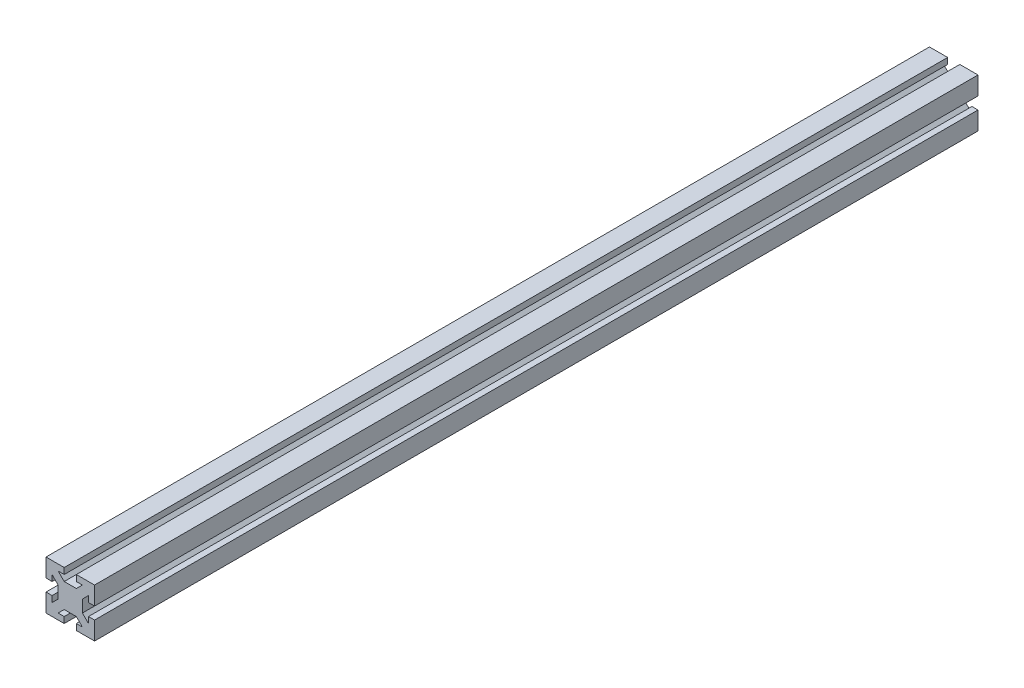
ISO-10303-21;
HEADER;
FILE_DESCRIPTION(('STEP AP214'),'2;1');
FILE_NAME('part.step','',(''),(''),'','','');
FILE_SCHEMA(('AUTOMOTIVE_DESIGN { 1 0 10303 214 1 1 1 1 }'));
ENDSEC;
DATA;
#1=APPLICATION_CONTEXT('core data for automotive mechanical design processes');
#2=APPLICATION_PROTOCOL_DEFINITION('international standard','automotive_design',2000,#1);
#3=PRODUCT_CONTEXT('',#1,'mechanical');
#4=PRODUCT('Part','Part','',(#3));
#5=PRODUCT_RELATED_PRODUCT_CATEGORY('part','',(#4));
#6=PRODUCT_DEFINITION_FORMATION('','',#4);
#7=PRODUCT_DEFINITION_CONTEXT('part definition',#1,'design');
#8=PRODUCT_DEFINITION('design','',#6,#7);
#9=PRODUCT_DEFINITION_SHAPE('','',#8);
#10=(LENGTH_UNIT() NAMED_UNIT(*) SI_UNIT(.MILLI.,.METRE.));
#11=(NAMED_UNIT(*) PLANE_ANGLE_UNIT() SI_UNIT($,.RADIAN.));
#12=(NAMED_UNIT(*) SI_UNIT($,.STERADIAN.) SOLID_ANGLE_UNIT());
#13=UNCERTAINTY_MEASURE_WITH_UNIT(LENGTH_MEASURE(1.E-05),#10,'distance_accuracy_value','');
#14=(GEOMETRIC_REPRESENTATION_CONTEXT(3) GLOBAL_UNCERTAINTY_ASSIGNED_CONTEXT((#13)) GLOBAL_UNIT_ASSIGNED_CONTEXT((#10,
#11,#12)) REPRESENTATION_CONTEXT('',''));
#15=CARTESIAN_POINT('',(0.,0.,0.));
#16=DIRECTION('',(0.,0.,1.));
#17=DIRECTION('',(1.,0.,0.));
#18=AXIS2_PLACEMENT_3D('',#15,#16,#17);
#19=CARTESIAN_POINT('',(20.,5.00000000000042,364.));
#20=DIRECTION('',(-1.,0.,0.));
#21=DIRECTION('',(0.,-1.,0.));
#22=AXIS2_PLACEMENT_3D('',#19,#20,#21);
#23=PLANE('',#22);
#24=DIRECTION('',(0.,1.,0.));
#25=VECTOR('',#24,1.);
#26=CARTESIAN_POINT('',(20.,5.00000000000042,-364.));
#27=LINE('',#26,#25);
#28=CARTESIAN_POINT('',(20.,5.00000000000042,-364.));
#29=VERTEX_POINT('',#28);
#30=CARTESIAN_POINT('',(20.,20.,-364.));
#31=VERTEX_POINT('',#30);
#32=EDGE_CURVE('E300',#29,#31,#27,.T.);
#33=ORIENTED_EDGE('',*,*,#32,.T.);
#34=DIRECTION('',(0.,0.,-1.));
#35=VECTOR('',#34,1.);
#36=CARTESIAN_POINT('',(20.,20.,364.));
#37=LINE('',#36,#35);
#38=CARTESIAN_POINT('',(20.,20.,364.));
#39=VERTEX_POINT('',#38);
#40=EDGE_CURVE('E11',#39,#31,#37,.T.);
#41=ORIENTED_EDGE('',*,*,#40,.F.);
#42=DIRECTION('',(0.,1.,0.));
#43=VECTOR('',#42,1.);
#44=CARTESIAN_POINT('',(20.,5.00000000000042,364.));
#45=LINE('',#44,#43);
#46=CARTESIAN_POINT('',(20.,5.00000000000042,364.));
#47=VERTEX_POINT('',#46);
#48=EDGE_CURVE('E370',#47,#39,#45,.T.);
#49=ORIENTED_EDGE('',*,*,#48,.F.);
#50=DIRECTION('',(0.,0.,-1.));
#51=VECTOR('',#50,1.);
#52=CARTESIAN_POINT('',(20.,5.00000000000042,364.));
#53=LINE('',#52,#51);
#54=EDGE_CURVE('E296',#47,#29,#53,.T.);
#55=ORIENTED_EDGE('',*,*,#54,.T.);
#56=EDGE_LOOP('',(#33,#41,#49,#55));
#57=FACE_BOUND('',#56,.T.);
#58=ADVANCED_FACE('F36',(#57),#23,.F.);
#59=CARTESIAN_POINT('',(5.,20.,364.));
#60=DIRECTION('',(0.,-1.,0.));
#61=DIRECTION('',(0.,0.,-1.));
#62=AXIS2_PLACEMENT_3D('',#59,#60,#61);
#63=PLANE('',#62);
#64=DIRECTION('',(-1.,0.,0.));
#65=VECTOR('',#64,1.);
#66=CARTESIAN_POINT('',(5.,20.,-364.));
#67=LINE('',#66,#65);
#68=CARTESIAN_POINT('',(5.,20.,-364.));
#69=VERTEX_POINT('',#68);
#70=EDGE_CURVE('E303',#31,#69,#67,.T.);
#71=ORIENTED_EDGE('',*,*,#70,.T.);
#72=DIRECTION('',(0.,0.,-1.));
#73=VECTOR('',#72,1.);
#74=CARTESIAN_POINT('',(5.,20.,364.));
#75=LINE('',#74,#73);
#76=CARTESIAN_POINT('',(5.,20.,364.));
#77=VERTEX_POINT('',#76);
#78=EDGE_CURVE('E44',#77,#69,#75,.T.);
#79=ORIENTED_EDGE('',*,*,#78,.F.);
#80=DIRECTION('',(-1.,0.,0.));
#81=VECTOR('',#80,1.);
#82=CARTESIAN_POINT('',(5.,20.,364.));
#83=LINE('',#82,#81);
#84=EDGE_CURVE('E179',#39,#77,#83,.T.);
#85=ORIENTED_EDGE('',*,*,#84,.F.);
#86=ORIENTED_EDGE('',*,*,#40,.T.);
#87=EDGE_LOOP('',(#71,#79,#85,#86));
#88=FACE_BOUND('',#87,.T.);
#89=ADVANCED_FACE('F568',(#88),#63,.F.);
#90=CARTESIAN_POINT('',(5.,15.,364.));
#91=DIRECTION('',(1.,0.,0.));
#92=DIRECTION('',(0.,0.,-1.));
#93=AXIS2_PLACEMENT_3D('',#90,#91,#92);
#94=PLANE('',#93);
#95=DIRECTION('',(0.,-1.,0.));
#96=VECTOR('',#95,1.);
#97=CARTESIAN_POINT('',(5.,15.,-364.));
#98=LINE('',#97,#96);
#99=CARTESIAN_POINT('',(5.,15.,-364.));
#100=VERTEX_POINT('',#99);
#101=EDGE_CURVE('E305',#69,#100,#98,.T.);
#102=ORIENTED_EDGE('',*,*,#101,.T.);
#103=DIRECTION('',(0.,0.,-1.));
#104=VECTOR('',#103,1.);
#105=CARTESIAN_POINT('',(5.,15.,364.));
#106=LINE('',#105,#104);
#107=CARTESIAN_POINT('',(5.,15.,364.));
#108=VERTEX_POINT('',#107);
#109=EDGE_CURVE('E461',#108,#100,#106,.T.);
#110=ORIENTED_EDGE('',*,*,#109,.F.);
#111=DIRECTION('',(0.,-1.,0.));
#112=VECTOR('',#111,1.);
#113=CARTESIAN_POINT('',(5.,15.,364.));
#114=LINE('',#113,#112);
#115=EDGE_CURVE('E469',#77,#108,#114,.T.);
#116=ORIENTED_EDGE('',*,*,#115,.F.);
#117=ORIENTED_EDGE('',*,*,#78,.T.);
#118=EDGE_LOOP('',(#102,#110,#116,#117));
#119=FACE_BOUND('',#118,.T.);
#120=ADVANCED_FACE('F467',(#119),#94,.F.);
#121=CARTESIAN_POINT('',(10.,15.,364.));
#122=DIRECTION('',(0.,1.,0.));
#123=DIRECTION('',(0.,0.,1.));
#124=AXIS2_PLACEMENT_3D('',#121,#122,#123);
#125=PLANE('',#124);
#126=DIRECTION('',(1.,0.,0.));
#127=VECTOR('',#126,1.);
#128=CARTESIAN_POINT('',(10.,15.,-364.));
#129=LINE('',#128,#127);
#130=CARTESIAN_POINT('',(10.,15.,-364.));
#131=VERTEX_POINT('',#130);
#132=EDGE_CURVE('E307',#100,#131,#129,.T.);
#133=ORIENTED_EDGE('',*,*,#132,.T.);
#134=DIRECTION('',(0.,0.,-1.));
#135=VECTOR('',#134,1.);
#136=CARTESIAN_POINT('',(10.,15.,364.));
#137=LINE('',#136,#135);
#138=CARTESIAN_POINT('',(10.,15.,364.));
#139=VERTEX_POINT('',#138);
#140=EDGE_CURVE('E458',#139,#131,#137,.T.);
#141=ORIENTED_EDGE('',*,*,#140,.F.);
#142=DIRECTION('',(1.,0.,0.));
#143=VECTOR('',#142,1.);
#144=CARTESIAN_POINT('',(10.,15.,364.));
#145=LINE('',#144,#143);
#146=EDGE_CURVE('E487',#108,#139,#145,.T.);
#147=ORIENTED_EDGE('',*,*,#146,.F.);
#148=ORIENTED_EDGE('',*,*,#109,.T.);
#149=EDGE_LOOP('',(#133,#141,#147,#148));
#150=FACE_BOUND('',#149,.T.);
#151=ADVANCED_FACE('F478',(#150),#125,.F.);
#152=CARTESIAN_POINT('',(5.,10.,364.));
#153=DIRECTION('',(0.707106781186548,-0.707106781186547,0.));
#154=DIRECTION('',(0.707106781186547,0.707106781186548,0.));
#155=AXIS2_PLACEMENT_3D('',#152,#153,#154);
#156=PLANE('',#155);
#157=DIRECTION('',(-0.707106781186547,-0.707106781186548,0.));
#158=VECTOR('',#157,1.);
#159=CARTESIAN_POINT('',(5.,10.,-364.));
#160=LINE('',#159,#158);
#161=CARTESIAN_POINT('',(5.,10.,-364.));
#162=VERTEX_POINT('',#161);
#163=EDGE_CURVE('E309',#131,#162,#160,.T.);
#164=ORIENTED_EDGE('',*,*,#163,.T.);
#165=DIRECTION('',(0.,0.,-1.));
#166=VECTOR('',#165,1.);
#167=CARTESIAN_POINT('',(5.,10.,364.));
#168=LINE('',#167,#166);
#169=CARTESIAN_POINT('',(5.,10.,364.));
#170=VERTEX_POINT('',#169);
#171=EDGE_CURVE('E455',#170,#162,#168,.T.);
#172=ORIENTED_EDGE('',*,*,#171,.F.);
#173=DIRECTION('',(-0.707106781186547,-0.707106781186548,0.));
#174=VECTOR('',#173,1.);
#175=CARTESIAN_POINT('',(5.,10.,364.));
#176=LINE('',#175,#174);
#177=EDGE_CURVE('E484',#139,#170,#176,.T.);
#178=ORIENTED_EDGE('',*,*,#177,.F.);
#179=ORIENTED_EDGE('',*,*,#140,.T.);
#180=EDGE_LOOP('',(#164,#172,#178,#179));
#181=FACE_BOUND('',#180,.T.);
#182=ADVANCED_FACE('F482',(#181),#156,.F.);
#183=CARTESIAN_POINT('',(-5.,10.,364.));
#184=DIRECTION('',(0.,-1.,0.));
#185=DIRECTION('',(0.,0.,-1.));
#186=AXIS2_PLACEMENT_3D('',#183,#184,#185);
#187=PLANE('',#186);
#188=DIRECTION('',(-1.,0.,0.));
#189=VECTOR('',#188,1.);
#190=CARTESIAN_POINT('',(-5.,10.,-364.));
#191=LINE('',#190,#189);
#192=CARTESIAN_POINT('',(-5.,10.,-364.));
#193=VERTEX_POINT('',#192);
#194=EDGE_CURVE('E311',#162,#193,#191,.T.);
#195=ORIENTED_EDGE('',*,*,#194,.T.);
#196=DIRECTION('',(0.,0.,-1.));
#197=VECTOR('',#196,1.);
#198=CARTESIAN_POINT('',(-5.,10.,364.));
#199=LINE('',#198,#197);
#200=CARTESIAN_POINT('',(-5.,10.,364.));
#201=VERTEX_POINT('',#200);
#202=EDGE_CURVE('E452',#201,#193,#199,.T.);
#203=ORIENTED_EDGE('',*,*,#202,.F.);
#204=DIRECTION('',(-1.,0.,0.));
#205=VECTOR('',#204,1.);
#206=CARTESIAN_POINT('',(-5.,10.,364.));
#207=LINE('',#206,#205);
#208=EDGE_CURVE('E486',#170,#201,#207,.T.);
#209=ORIENTED_EDGE('',*,*,#208,.F.);
#210=ORIENTED_EDGE('',*,*,#171,.T.);
#211=EDGE_LOOP('',(#195,#203,#209,#210));
#212=FACE_BOUND('',#211,.T.);
#213=ADVANCED_FACE('F581',(#212),#187,.F.);
#214=CARTESIAN_POINT('',(-10.,15.,364.));
#215=DIRECTION('',(-0.707106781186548,-0.707106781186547,0.));
#216=DIRECTION('',(0.707106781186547,-0.707106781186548,0.));
#217=AXIS2_PLACEMENT_3D('',#214,#215,#216);
#218=PLANE('',#217);
#219=DIRECTION('',(-0.707106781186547,0.707106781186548,0.));
#220=VECTOR('',#219,1.);
#221=CARTESIAN_POINT('',(-10.,15.,-364.));
#222=LINE('',#221,#220);
#223=CARTESIAN_POINT('',(-10.,15.,-364.));
#224=VERTEX_POINT('',#223);
#225=EDGE_CURVE('E313',#193,#224,#222,.T.);
#226=ORIENTED_EDGE('',*,*,#225,.T.);
#227=DIRECTION('',(0.,0.,-1.));
#228=VECTOR('',#227,1.);
#229=CARTESIAN_POINT('',(-10.,15.,364.));
#230=LINE('',#229,#228);
#231=CARTESIAN_POINT('',(-10.,15.,364.));
#232=VERTEX_POINT('',#231);
#233=EDGE_CURVE('E449',#232,#224,#230,.T.);
#234=ORIENTED_EDGE('',*,*,#233,.F.);
#235=DIRECTION('',(-0.707106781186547,0.707106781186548,0.));
#236=VECTOR('',#235,1.);
#237=CARTESIAN_POINT('',(-10.,15.,364.));
#238=LINE('',#237,#236);
#239=EDGE_CURVE('E489',#201,#232,#238,.T.);
#240=ORIENTED_EDGE('',*,*,#239,.F.);
#241=ORIENTED_EDGE('',*,*,#202,.T.);
#242=EDGE_LOOP('',(#226,#234,#240,#241));
#243=FACE_BOUND('',#242,.T.);
#244=ADVANCED_FACE('F584',(#243),#218,.F.);
#245=CARTESIAN_POINT('',(-5.,15.,364.));
#246=DIRECTION('',(0.,1.,0.));
#247=DIRECTION('',(0.,0.,1.));
#248=AXIS2_PLACEMENT_3D('',#245,#246,#247);
#249=PLANE('',#248);
#250=DIRECTION('',(1.,0.,0.));
#251=VECTOR('',#250,1.);
#252=CARTESIAN_POINT('',(-5.,15.,-364.));
#253=LINE('',#252,#251);
#254=CARTESIAN_POINT('',(-5.,15.,-364.));
#255=VERTEX_POINT('',#254);
#256=EDGE_CURVE('E315',#224,#255,#253,.T.);
#257=ORIENTED_EDGE('',*,*,#256,.T.);
#258=DIRECTION('',(0.,0.,-1.));
#259=VECTOR('',#258,1.);
#260=CARTESIAN_POINT('',(-5.,15.,364.));
#261=LINE('',#260,#259);
#262=CARTESIAN_POINT('',(-5.,15.,364.));
#263=VERTEX_POINT('',#262);
#264=EDGE_CURVE('E446',#263,#255,#261,.T.);
#265=ORIENTED_EDGE('',*,*,#264,.F.);
#266=DIRECTION('',(1.,0.,0.));
#267=VECTOR('',#266,1.);
#268=CARTESIAN_POINT('',(-5.,15.,364.));
#269=LINE('',#268,#267);
#270=EDGE_CURVE('E495',#232,#263,#269,.T.);
#271=ORIENTED_EDGE('',*,*,#270,.F.);
#272=ORIENTED_EDGE('',*,*,#233,.T.);
#273=EDGE_LOOP('',(#257,#265,#271,#272));
#274=FACE_BOUND('',#273,.T.);
#275=ADVANCED_FACE('F588',(#274),#249,.F.);
#276=CARTESIAN_POINT('',(-5.,20.,364.));
#277=DIRECTION('',(-1.,0.,0.));
#278=DIRECTION('',(0.,0.,1.));
#279=AXIS2_PLACEMENT_3D('',#276,#277,#278);
#280=PLANE('',#279);
#281=DIRECTION('',(0.,1.,0.));
#282=VECTOR('',#281,1.);
#283=CARTESIAN_POINT('',(-5.,20.,-364.));
#284=LINE('',#283,#282);
#285=CARTESIAN_POINT('',(-5.,20.,-364.));
#286=VERTEX_POINT('',#285);
#287=EDGE_CURVE('E317',#255,#286,#284,.T.);
#288=ORIENTED_EDGE('',*,*,#287,.T.);
#289=DIRECTION('',(0.,0.,-1.));
#290=VECTOR('',#289,1.);
#291=CARTESIAN_POINT('',(-5.,20.,364.));
#292=LINE('',#291,#290);
#293=CARTESIAN_POINT('',(-5.,20.,364.));
#294=VERTEX_POINT('',#293);
#295=EDGE_CURVE('E443',#294,#286,#292,.T.);
#296=ORIENTED_EDGE('',*,*,#295,.F.);
#297=DIRECTION('',(0.,1.,0.));
#298=VECTOR('',#297,1.);
#299=CARTESIAN_POINT('',(-5.,20.,364.));
#300=LINE('',#299,#298);
#301=EDGE_CURVE('E497',#263,#294,#300,.T.);
#302=ORIENTED_EDGE('',*,*,#301,.F.);
#303=ORIENTED_EDGE('',*,*,#264,.T.);
#304=EDGE_LOOP('',(#288,#296,#302,#303));
#305=FACE_BOUND('',#304,.T.);
#306=ADVANCED_FACE('F592',(#305),#280,.F.);
#307=CARTESIAN_POINT('',(-20.,20.,364.));
#308=DIRECTION('',(0.,-1.,0.));
#309=DIRECTION('',(0.,0.,-1.));
#310=AXIS2_PLACEMENT_3D('',#307,#308,#309);
#311=PLANE('',#310);
#312=DIRECTION('',(-1.,0.,0.));
#313=VECTOR('',#312,1.);
#314=CARTESIAN_POINT('',(-20.,20.,-364.));
#315=LINE('',#314,#313);
#316=CARTESIAN_POINT('',(-20.,20.,-364.));
#317=VERTEX_POINT('',#316);
#318=EDGE_CURVE('E319',#286,#317,#315,.T.);
#319=ORIENTED_EDGE('',*,*,#318,.T.);
#320=DIRECTION('',(0.,0.,-1.));
#321=VECTOR('',#320,1.);
#322=CARTESIAN_POINT('',(-20.,20.,364.));
#323=LINE('',#322,#321);
#324=CARTESIAN_POINT('',(-20.,20.,364.));
#325=VERTEX_POINT('',#324);
#326=EDGE_CURVE('E440',#325,#317,#323,.T.);
#327=ORIENTED_EDGE('',*,*,#326,.F.);
#328=DIRECTION('',(-1.,0.,0.));
#329=VECTOR('',#328,1.);
#330=CARTESIAN_POINT('',(-20.,20.,364.));
#331=LINE('',#330,#329);
#332=EDGE_CURVE('E499',#294,#325,#331,.T.);
#333=ORIENTED_EDGE('',*,*,#332,.F.);
#334=ORIENTED_EDGE('',*,*,#295,.T.);
#335=EDGE_LOOP('',(#319,#327,#333,#334));
#336=FACE_BOUND('',#335,.T.);
#337=ADVANCED_FACE('F596',(#336),#311,.F.);
#338=CARTESIAN_POINT('',(-20.,5.,364.));
#339=DIRECTION('',(1.,0.,0.));
#340=DIRECTION('',(0.,1.,0.));
#341=AXIS2_PLACEMENT_3D('',#338,#339,#340);
#342=PLANE('',#341);
#343=DIRECTION('',(0.,-1.,0.));
#344=VECTOR('',#343,1.);
#345=CARTESIAN_POINT('',(-20.,5.,-364.));
#346=LINE('',#345,#344);
#347=CARTESIAN_POINT('',(-20.,5.,-364.));
#348=VERTEX_POINT('',#347);
#349=EDGE_CURVE('E321',#317,#348,#346,.T.);
#350=ORIENTED_EDGE('',*,*,#349,.T.);
#351=DIRECTION('',(0.,0.,-1.));
#352=VECTOR('',#351,1.);
#353=CARTESIAN_POINT('',(-20.,5.,364.));
#354=LINE('',#353,#352);
#355=CARTESIAN_POINT('',(-20.,5.,364.));
#356=VERTEX_POINT('',#355);
#357=EDGE_CURVE('E437',#356,#348,#354,.T.);
#358=ORIENTED_EDGE('',*,*,#357,.F.);
#359=DIRECTION('',(0.,-1.,0.));
#360=VECTOR('',#359,1.);
#361=CARTESIAN_POINT('',(-20.,5.,364.));
#362=LINE('',#361,#360);
#363=EDGE_CURVE('E501',#325,#356,#362,.T.);
#364=ORIENTED_EDGE('',*,*,#363,.F.);
#365=ORIENTED_EDGE('',*,*,#326,.T.);
#366=EDGE_LOOP('',(#350,#358,#364,#365));
#367=FACE_BOUND('',#366,.T.);
#368=ADVANCED_FACE('F600',(#367),#342,.F.);
#369=CARTESIAN_POINT('',(-15.,5.,364.));
#370=DIRECTION('',(0.,1.,0.));
#371=DIRECTION('',(0.,0.,1.));
#372=AXIS2_PLACEMENT_3D('',#369,#370,#371);
#373=PLANE('',#372);
#374=DIRECTION('',(1.,0.,0.));
#375=VECTOR('',#374,1.);
#376=CARTESIAN_POINT('',(-15.,5.,-364.));
#377=LINE('',#376,#375);
#378=CARTESIAN_POINT('',(-15.,5.,-364.));
#379=VERTEX_POINT('',#378);
#380=EDGE_CURVE('E323',#348,#379,#377,.T.);
#381=ORIENTED_EDGE('',*,*,#380,.T.);
#382=DIRECTION('',(0.,0.,-1.));
#383=VECTOR('',#382,1.);
#384=CARTESIAN_POINT('',(-15.,5.,364.));
#385=LINE('',#384,#383);
#386=CARTESIAN_POINT('',(-15.,5.,364.));
#387=VERTEX_POINT('',#386);
#388=EDGE_CURVE('E434',#387,#379,#385,.T.);
#389=ORIENTED_EDGE('',*,*,#388,.F.);
#390=DIRECTION('',(1.,0.,0.));
#391=VECTOR('',#390,1.);
#392=CARTESIAN_POINT('',(-15.,5.,364.));
#393=LINE('',#392,#391);
#394=EDGE_CURVE('E503',#356,#387,#393,.T.);
#395=ORIENTED_EDGE('',*,*,#394,.F.);
#396=ORIENTED_EDGE('',*,*,#357,.T.);
#397=EDGE_LOOP('',(#381,#389,#395,#396));
#398=FACE_BOUND('',#397,.T.);
#399=ADVANCED_FACE('F604',(#398),#373,.F.);
#400=CARTESIAN_POINT('',(-14.9999999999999,10.0000000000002,364.));
#401=DIRECTION('',(-1.,0.,0.));
#402=DIRECTION('',(0.,-1.,0.));
#403=AXIS2_PLACEMENT_3D('',#400,#401,#402);
#404=PLANE('',#403);
#405=DIRECTION('',(0.,1.,0.));
#406=VECTOR('',#405,1.);
#407=CARTESIAN_POINT('',(-14.9999999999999,10.0000000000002,-364.));
#408=LINE('',#407,#406);
#409=CARTESIAN_POINT('',(-14.9999999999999,10.0000000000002,-364.));
#410=VERTEX_POINT('',#409);
#411=EDGE_CURVE('E325',#379,#410,#408,.T.);
#412=ORIENTED_EDGE('',*,*,#411,.T.);
#413=DIRECTION('',(0.,0.,-1.));
#414=VECTOR('',#413,1.);
#415=CARTESIAN_POINT('',(-14.9999999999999,10.0000000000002,364.));
#416=LINE('',#415,#414);
#417=CARTESIAN_POINT('',(-14.9999999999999,10.0000000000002,364.));
#418=VERTEX_POINT('',#417);
#419=EDGE_CURVE('E431',#418,#410,#416,.T.);
#420=ORIENTED_EDGE('',*,*,#419,.F.);
#421=DIRECTION('',(0.,1.,0.));
#422=VECTOR('',#421,1.);
#423=CARTESIAN_POINT('',(-14.9999999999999,10.0000000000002,364.));
#424=LINE('',#423,#422);
#425=EDGE_CURVE('E505',#387,#418,#424,.T.);
#426=ORIENTED_EDGE('',*,*,#425,.F.);
#427=ORIENTED_EDGE('',*,*,#388,.T.);
#428=EDGE_LOOP('',(#412,#420,#426,#427));
#429=FACE_BOUND('',#428,.T.);
#430=ADVANCED_FACE('F608',(#429),#404,.F.);
#431=CARTESIAN_POINT('',(-10.,5.,364.));
#432=DIRECTION('',(0.707106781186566,0.707106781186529,0.));
#433=DIRECTION('',(-0.707106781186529,0.707106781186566,0.));
#434=AXIS2_PLACEMENT_3D('',#431,#432,#433);
#435=PLANE('',#434);
#436=DIRECTION('',(0.707106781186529,-0.707106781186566,0.));
#437=VECTOR('',#436,1.);
#438=CARTESIAN_POINT('',(-10.,5.,-364.));
#439=LINE('',#438,#437);
#440=CARTESIAN_POINT('',(-10.,5.,-364.));
#441=VERTEX_POINT('',#440);
#442=EDGE_CURVE('E327',#410,#441,#439,.T.);
#443=ORIENTED_EDGE('',*,*,#442,.T.);
#444=DIRECTION('',(0.,0.,-1.));
#445=VECTOR('',#444,1.);
#446=CARTESIAN_POINT('',(-10.,5.,364.));
#447=LINE('',#446,#445);
#448=CARTESIAN_POINT('',(-10.,5.,364.));
#449=VERTEX_POINT('',#448);
#450=EDGE_CURVE('E428',#449,#441,#447,.T.);
#451=ORIENTED_EDGE('',*,*,#450,.F.);
#452=DIRECTION('',(0.707106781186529,-0.707106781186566,0.));
#453=VECTOR('',#452,1.);
#454=CARTESIAN_POINT('',(-10.,5.,364.));
#455=LINE('',#454,#453);
#456=EDGE_CURVE('E507',#418,#449,#455,.T.);
#457=ORIENTED_EDGE('',*,*,#456,.F.);
#458=ORIENTED_EDGE('',*,*,#419,.T.);
#459=EDGE_LOOP('',(#443,#451,#457,#458));
#460=FACE_BOUND('',#459,.T.);
#461=ADVANCED_FACE('F612',(#460),#435,.F.);
#462=CARTESIAN_POINT('',(-9.99999999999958,-4.99999999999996,364.));
#463=DIRECTION('',(1.,0.,0.));
#464=DIRECTION('',(0.,1.,0.));
#465=AXIS2_PLACEMENT_3D('',#462,#463,#464);
#466=PLANE('',#465);
#467=DIRECTION('',(0.,-1.,0.));
#468=VECTOR('',#467,1.);
#469=CARTESIAN_POINT('',(-9.99999999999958,-4.99999999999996,-364.));
#470=LINE('',#469,#468);
#471=CARTESIAN_POINT('',(-9.99999999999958,-4.99999999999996,-364.));
#472=VERTEX_POINT('',#471);
#473=EDGE_CURVE('E329',#441,#472,#470,.T.);
#474=ORIENTED_EDGE('',*,*,#473,.T.);
#475=DIRECTION('',(0.,0.,-1.));
#476=VECTOR('',#475,1.);
#477=CARTESIAN_POINT('',(-9.99999999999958,-4.99999999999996,364.));
#478=LINE('',#477,#476);
#479=CARTESIAN_POINT('',(-9.99999999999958,-4.99999999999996,364.));
#480=VERTEX_POINT('',#479);
#481=EDGE_CURVE('E425',#480,#472,#478,.T.);
#482=ORIENTED_EDGE('',*,*,#481,.F.);
#483=DIRECTION('',(0.,-1.,0.));
#484=VECTOR('',#483,1.);
#485=CARTESIAN_POINT('',(-9.99999999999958,-4.99999999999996,364.));
#486=LINE('',#485,#484);
#487=EDGE_CURVE('E509',#449,#480,#486,.T.);
#488=ORIENTED_EDGE('',*,*,#487,.F.);
#489=ORIENTED_EDGE('',*,*,#450,.T.);
#490=EDGE_LOOP('',(#474,#482,#488,#489));
#491=FACE_BOUND('',#490,.T.);
#492=ADVANCED_FACE('F616',(#491),#466,.F.);
#493=CARTESIAN_POINT('',(-14.9999999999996,-9.99999999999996,364.));
#494=DIRECTION('',(0.707106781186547,-0.707106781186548,0.));
#495=DIRECTION('',(0.707106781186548,0.707106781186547,0.));
#496=AXIS2_PLACEMENT_3D('',#493,#494,#495);
#497=PLANE('',#496);
#498=DIRECTION('',(-0.707106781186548,-0.707106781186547,0.));
#499=VECTOR('',#498,1.);
#500=CARTESIAN_POINT('',(-14.9999999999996,-9.99999999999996,-364.));
#501=LINE('',#500,#499);
#502=CARTESIAN_POINT('',(-14.9999999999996,-9.99999999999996,-364.));
#503=VERTEX_POINT('',#502);
#504=EDGE_CURVE('E331',#472,#503,#501,.T.);
#505=ORIENTED_EDGE('',*,*,#504,.T.);
#506=DIRECTION('',(0.,0.,-1.));
#507=VECTOR('',#506,1.);
#508=CARTESIAN_POINT('',(-14.9999999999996,-9.99999999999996,364.));
#509=LINE('',#508,#507);
#510=CARTESIAN_POINT('',(-14.9999999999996,-9.99999999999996,364.));
#511=VERTEX_POINT('',#510);
#512=EDGE_CURVE('E422',#511,#503,#509,.T.);
#513=ORIENTED_EDGE('',*,*,#512,.F.);
#514=DIRECTION('',(-0.707106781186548,-0.707106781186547,0.));
#515=VECTOR('',#514,1.);
#516=CARTESIAN_POINT('',(-14.9999999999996,-9.99999999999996,364.));
#517=LINE('',#516,#515);
#518=EDGE_CURVE('E511',#480,#511,#517,.T.);
#519=ORIENTED_EDGE('',*,*,#518,.F.);
#520=ORIENTED_EDGE('',*,*,#481,.T.);
#521=EDGE_LOOP('',(#505,#513,#519,#520));
#522=FACE_BOUND('',#521,.T.);
#523=ADVANCED_FACE('F620',(#522),#497,.F.);
#524=CARTESIAN_POINT('',(-14.9999999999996,-4.99999999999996,364.));
#525=DIRECTION('',(-1.,0.,0.));
#526=DIRECTION('',(0.,0.,1.));
#527=AXIS2_PLACEMENT_3D('',#524,#525,#526);
#528=PLANE('',#527);
#529=DIRECTION('',(0.,1.,0.));
#530=VECTOR('',#529,1.);
#531=CARTESIAN_POINT('',(-14.9999999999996,-4.99999999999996,-364.));
#532=LINE('',#531,#530);
#533=CARTESIAN_POINT('',(-14.9999999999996,-4.99999999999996,-364.));
#534=VERTEX_POINT('',#533);
#535=EDGE_CURVE('E333',#503,#534,#532,.T.);
#536=ORIENTED_EDGE('',*,*,#535,.T.);
#537=DIRECTION('',(0.,0.,-1.));
#538=VECTOR('',#537,1.);
#539=CARTESIAN_POINT('',(-14.9999999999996,-4.99999999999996,364.));
#540=LINE('',#539,#538);
#541=CARTESIAN_POINT('',(-14.9999999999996,-4.99999999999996,364.));
#542=VERTEX_POINT('',#541);
#543=EDGE_CURVE('E419',#542,#534,#540,.T.);
#544=ORIENTED_EDGE('',*,*,#543,.F.);
#545=DIRECTION('',(0.,1.,0.));
#546=VECTOR('',#545,1.);
#547=CARTESIAN_POINT('',(-14.9999999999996,-4.99999999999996,364.));
#548=LINE('',#547,#546);
#549=EDGE_CURVE('E513',#511,#542,#548,.T.);
#550=ORIENTED_EDGE('',*,*,#549,.F.);
#551=ORIENTED_EDGE('',*,*,#512,.T.);
#552=EDGE_LOOP('',(#536,#544,#550,#551));
#553=FACE_BOUND('',#552,.T.);
#554=ADVANCED_FACE('F624',(#553),#528,.F.);
#555=CARTESIAN_POINT('',(-19.9999999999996,-4.99999999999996,364.));
#556=DIRECTION('',(0.,-1.,0.));
#557=DIRECTION('',(1.,0.,0.));
#558=AXIS2_PLACEMENT_3D('',#555,#556,#557);
#559=PLANE('',#558);
#560=DIRECTION('',(-1.,0.,0.));
#561=VECTOR('',#560,1.);
#562=CARTESIAN_POINT('',(-19.9999999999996,-4.99999999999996,-364.));
#563=LINE('',#562,#561);
#564=CARTESIAN_POINT('',(-19.9999999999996,-4.99999999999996,-364.));
#565=VERTEX_POINT('',#564);
#566=EDGE_CURVE('E335',#534,#565,#563,.T.);
#567=ORIENTED_EDGE('',*,*,#566,.T.);
#568=DIRECTION('',(0.,0.,-1.));
#569=VECTOR('',#568,1.);
#570=CARTESIAN_POINT('',(-19.9999999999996,-4.99999999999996,364.));
#571=LINE('',#570,#569);
#572=CARTESIAN_POINT('',(-19.9999999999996,-4.99999999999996,364.));
#573=VERTEX_POINT('',#572);
#574=EDGE_CURVE('E416',#573,#565,#571,.T.);
#575=ORIENTED_EDGE('',*,*,#574,.F.);
#576=DIRECTION('',(-1.,0.,0.));
#577=VECTOR('',#576,1.);
#578=CARTESIAN_POINT('',(-19.9999999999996,-4.99999999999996,364.));
#579=LINE('',#578,#577);
#580=EDGE_CURVE('E515',#542,#573,#579,.T.);
#581=ORIENTED_EDGE('',*,*,#580,.F.);
#582=ORIENTED_EDGE('',*,*,#543,.T.);
#583=EDGE_LOOP('',(#567,#575,#581,#582));
#584=FACE_BOUND('',#583,.T.);
#585=ADVANCED_FACE('F628',(#584),#559,.F.);
#586=CARTESIAN_POINT('',(-20.,-20.,364.));
#587=DIRECTION('',(1.,0.,0.));
#588=DIRECTION('',(0.,1.,0.));
#589=AXIS2_PLACEMENT_3D('',#586,#587,#588);
#590=PLANE('',#589);
#591=DIRECTION('',(0.,-1.,0.));
#592=VECTOR('',#591,1.);
#593=CARTESIAN_POINT('',(-20.,-20.,-364.));
#594=LINE('',#593,#592);
#595=CARTESIAN_POINT('',(-20.,-20.,-364.));
#596=VERTEX_POINT('',#595);
#597=EDGE_CURVE('E337',#565,#596,#594,.T.);
#598=ORIENTED_EDGE('',*,*,#597,.T.);
#599=DIRECTION('',(0.,0.,-1.));
#600=VECTOR('',#599,1.);
#601=CARTESIAN_POINT('',(-20.,-20.,364.));
#602=LINE('',#601,#600);
#603=CARTESIAN_POINT('',(-20.,-20.,364.));
#604=VERTEX_POINT('',#603);
#605=EDGE_CURVE('E413',#604,#596,#602,.T.);
#606=ORIENTED_EDGE('',*,*,#605,.F.);
#607=DIRECTION('',(0.,-1.,0.));
#608=VECTOR('',#607,1.);
#609=CARTESIAN_POINT('',(-20.,-20.,364.));
#610=LINE('',#609,#608);
#611=EDGE_CURVE('E517',#573,#604,#610,.T.);
#612=ORIENTED_EDGE('',*,*,#611,.F.);
#613=ORIENTED_EDGE('',*,*,#574,.T.);
#614=EDGE_LOOP('',(#598,#606,#612,#613));
#615=FACE_BOUND('',#614,.T.);
#616=ADVANCED_FACE('F632',(#615),#590,.F.);
#617=CARTESIAN_POINT('',(-20.,-20.,364.));
#618=DIRECTION('',(0.,1.,0.));
#619=DIRECTION('',(-1.,0.,0.));
#620=AXIS2_PLACEMENT_3D('',#617,#618,#619);
#621=PLANE('',#620);
#622=DIRECTION('',(1.,0.,0.));
#623=VECTOR('',#622,1.);
#624=CARTESIAN_POINT('',(-20.,-20.,-364.));
#625=LINE('',#624,#623);
#626=CARTESIAN_POINT('',(-5.,-20.,-364.));
#627=VERTEX_POINT('',#626);
#628=EDGE_CURVE('E339',#596,#627,#625,.T.);
#629=ORIENTED_EDGE('',*,*,#628,.T.);
#630=DIRECTION('',(0.,0.,-1.));
#631=VECTOR('',#630,1.);
#632=CARTESIAN_POINT('',(-5.,-20.,364.));
#633=LINE('',#632,#631);
#634=CARTESIAN_POINT('',(-5.,-20.,364.));
#635=VERTEX_POINT('',#634);
#636=EDGE_CURVE('E410',#635,#627,#633,.T.);
#637=ORIENTED_EDGE('',*,*,#636,.F.);
#638=DIRECTION('',(1.,0.,0.));
#639=VECTOR('',#638,1.);
#640=CARTESIAN_POINT('',(-20.,-20.,364.));
#641=LINE('',#640,#639);
#642=EDGE_CURVE('E519',#604,#635,#641,.T.);
#643=ORIENTED_EDGE('',*,*,#642,.F.);
#644=ORIENTED_EDGE('',*,*,#605,.T.);
#645=EDGE_LOOP('',(#629,#637,#643,#644));
#646=FACE_BOUND('',#645,.T.);
#647=ADVANCED_FACE('F636',(#646),#621,.F.);
#648=CARTESIAN_POINT('',(-5.,-15.,364.));
#649=DIRECTION('',(-1.,0.,0.));
#650=DIRECTION('',(0.,0.,1.));
#651=AXIS2_PLACEMENT_3D('',#648,#649,#650);
#652=PLANE('',#651);
#653=DIRECTION('',(0.,1.,0.));
#654=VECTOR('',#653,1.);
#655=CARTESIAN_POINT('',(-5.,-15.,-364.));
#656=LINE('',#655,#654);
#657=CARTESIAN_POINT('',(-5.,-15.,-364.));
#658=VERTEX_POINT('',#657);
#659=EDGE_CURVE('E341',#627,#658,#656,.T.);
#660=ORIENTED_EDGE('',*,*,#659,.T.);
#661=DIRECTION('',(0.,0.,-1.));
#662=VECTOR('',#661,1.);
#663=CARTESIAN_POINT('',(-5.,-15.,364.));
#664=LINE('',#663,#662);
#665=CARTESIAN_POINT('',(-5.,-15.,364.));
#666=VERTEX_POINT('',#665);
#667=EDGE_CURVE('E407',#666,#658,#664,.T.);
#668=ORIENTED_EDGE('',*,*,#667,.F.);
#669=DIRECTION('',(0.,1.,0.));
#670=VECTOR('',#669,1.);
#671=CARTESIAN_POINT('',(-5.,-15.,364.));
#672=LINE('',#671,#670);
#673=EDGE_CURVE('E521',#635,#666,#672,.T.);
#674=ORIENTED_EDGE('',*,*,#673,.F.);
#675=ORIENTED_EDGE('',*,*,#636,.T.);
#676=EDGE_LOOP('',(#660,#668,#674,#675));
#677=FACE_BOUND('',#676,.T.);
#678=ADVANCED_FACE('F640',(#677),#652,.F.);
#679=CARTESIAN_POINT('',(-9.99999999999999,-15.,364.));
#680=DIRECTION('',(0.,-1.,0.));
#681=DIRECTION('',(1.,0.,0.));
#682=AXIS2_PLACEMENT_3D('',#679,#680,#681);
#683=PLANE('',#682);
#684=DIRECTION('',(-1.,0.,0.));
#685=VECTOR('',#684,1.);
#686=CARTESIAN_POINT('',(-9.99999999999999,-15.,-364.));
#687=LINE('',#686,#685);
#688=CARTESIAN_POINT('',(-9.99999999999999,-15.,-364.));
#689=VERTEX_POINT('',#688);
#690=EDGE_CURVE('E343',#658,#689,#687,.T.);
#691=ORIENTED_EDGE('',*,*,#690,.T.);
#692=DIRECTION('',(0.,0.,-1.));
#693=VECTOR('',#692,1.);
#694=CARTESIAN_POINT('',(-9.99999999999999,-15.,364.));
#695=LINE('',#694,#693);
#696=CARTESIAN_POINT('',(-9.99999999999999,-15.,364.));
#697=VERTEX_POINT('',#696);
#698=EDGE_CURVE('E404',#697,#689,#695,.T.);
#699=ORIENTED_EDGE('',*,*,#698,.F.);
#700=DIRECTION('',(-1.,0.,0.));
#701=VECTOR('',#700,1.);
#702=CARTESIAN_POINT('',(-9.99999999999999,-15.,364.));
#703=LINE('',#702,#701);
#704=EDGE_CURVE('E523',#666,#697,#703,.T.);
#705=ORIENTED_EDGE('',*,*,#704,.F.);
#706=ORIENTED_EDGE('',*,*,#667,.T.);
#707=EDGE_LOOP('',(#691,#699,#705,#706));
#708=FACE_BOUND('',#707,.T.);
#709=ADVANCED_FACE('F644',(#708),#683,.F.);
#710=CARTESIAN_POINT('',(-5.,-10.,364.));
#711=DIRECTION('',(-0.707106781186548,0.707106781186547,0.));
#712=DIRECTION('',(-0.707106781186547,-0.707106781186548,0.));
#713=AXIS2_PLACEMENT_3D('',#710,#711,#712);
#714=PLANE('',#713);
#715=DIRECTION('',(0.707106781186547,0.707106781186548,0.));
#716=VECTOR('',#715,1.);
#717=CARTESIAN_POINT('',(-5.,-10.,-364.));
#718=LINE('',#717,#716);
#719=CARTESIAN_POINT('',(-5.,-10.,-364.));
#720=VERTEX_POINT('',#719);
#721=EDGE_CURVE('E345',#689,#720,#718,.T.);
#722=ORIENTED_EDGE('',*,*,#721,.T.);
#723=DIRECTION('',(0.,0.,-1.));
#724=VECTOR('',#723,1.);
#725=CARTESIAN_POINT('',(-5.,-10.,364.));
#726=LINE('',#725,#724);
#727=CARTESIAN_POINT('',(-5.,-10.,364.));
#728=VERTEX_POINT('',#727);
#729=EDGE_CURVE('E401',#728,#720,#726,.T.);
#730=ORIENTED_EDGE('',*,*,#729,.F.);
#731=DIRECTION('',(0.707106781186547,0.707106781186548,0.));
#732=VECTOR('',#731,1.);
#733=CARTESIAN_POINT('',(-5.,-10.,364.));
#734=LINE('',#733,#732);
#735=EDGE_CURVE('E525',#697,#728,#734,.T.);
#736=ORIENTED_EDGE('',*,*,#735,.F.);
#737=ORIENTED_EDGE('',*,*,#698,.T.);
#738=EDGE_LOOP('',(#722,#730,#736,#737));
#739=FACE_BOUND('',#738,.T.);
#740=ADVANCED_FACE('F648',(#739),#714,.F.);
#741=CARTESIAN_POINT('',(5.,-10.,364.));
#742=DIRECTION('',(0.,1.,0.));
#743=DIRECTION('',(0.,0.,1.));
#744=AXIS2_PLACEMENT_3D('',#741,#742,#743);
#745=PLANE('',#744);
#746=DIRECTION('',(1.,0.,0.));
#747=VECTOR('',#746,1.);
#748=CARTESIAN_POINT('',(5.,-10.,-364.));
#749=LINE('',#748,#747);
#750=CARTESIAN_POINT('',(5.,-10.,-364.));
#751=VERTEX_POINT('',#750);
#752=EDGE_CURVE('E347',#720,#751,#749,.T.);
#753=ORIENTED_EDGE('',*,*,#752,.T.);
#754=DIRECTION('',(0.,0.,-1.));
#755=VECTOR('',#754,1.);
#756=CARTESIAN_POINT('',(5.,-10.,364.));
#757=LINE('',#756,#755);
#758=CARTESIAN_POINT('',(5.,-10.,364.));
#759=VERTEX_POINT('',#758);
#760=EDGE_CURVE('E398',#759,#751,#757,.T.);
#761=ORIENTED_EDGE('',*,*,#760,.F.);
#762=DIRECTION('',(1.,0.,0.));
#763=VECTOR('',#762,1.);
#764=CARTESIAN_POINT('',(5.,-10.,364.));
#765=LINE('',#764,#763);
#766=EDGE_CURVE('E527',#728,#759,#765,.T.);
#767=ORIENTED_EDGE('',*,*,#766,.F.);
#768=ORIENTED_EDGE('',*,*,#729,.T.);
#769=EDGE_LOOP('',(#753,#761,#767,#768));
#770=FACE_BOUND('',#769,.T.);
#771=ADVANCED_FACE('F652',(#770),#745,.F.);
#772=CARTESIAN_POINT('',(10.,-15.,364.));
#773=DIRECTION('',(0.707106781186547,0.707106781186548,0.));
#774=DIRECTION('',(-0.707106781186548,0.707106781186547,0.));
#775=AXIS2_PLACEMENT_3D('',#772,#773,#774);
#776=PLANE('',#775);
#777=DIRECTION('',(0.707106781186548,-0.707106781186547,0.));
#778=VECTOR('',#777,1.);
#779=CARTESIAN_POINT('',(10.,-15.,-364.));
#780=LINE('',#779,#778);
#781=CARTESIAN_POINT('',(10.,-15.,-364.));
#782=VERTEX_POINT('',#781);
#783=EDGE_CURVE('E349',#751,#782,#780,.T.);
#784=ORIENTED_EDGE('',*,*,#783,.T.);
#785=DIRECTION('',(0.,0.,-1.));
#786=VECTOR('',#785,1.);
#787=CARTESIAN_POINT('',(10.,-15.,364.));
#788=LINE('',#787,#786);
#789=CARTESIAN_POINT('',(10.,-15.,364.));
#790=VERTEX_POINT('',#789);
#791=EDGE_CURVE('E395',#790,#782,#788,.T.);
#792=ORIENTED_EDGE('',*,*,#791,.F.);
#793=DIRECTION('',(0.707106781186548,-0.707106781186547,0.));
#794=VECTOR('',#793,1.);
#795=CARTESIAN_POINT('',(10.,-15.,364.));
#796=LINE('',#795,#794);
#797=EDGE_CURVE('E529',#759,#790,#796,.T.);
#798=ORIENTED_EDGE('',*,*,#797,.F.);
#799=ORIENTED_EDGE('',*,*,#760,.T.);
#800=EDGE_LOOP('',(#784,#792,#798,#799));
#801=FACE_BOUND('',#800,.T.);
#802=ADVANCED_FACE('F656',(#801),#776,.F.);
#803=CARTESIAN_POINT('',(5.,-15.,364.));
#804=DIRECTION('',(0.,-1.,0.));
#805=DIRECTION('',(1.,0.,0.));
#806=AXIS2_PLACEMENT_3D('',#803,#804,#805);
#807=PLANE('',#806);
#808=DIRECTION('',(-1.,0.,0.));
#809=VECTOR('',#808,1.);
#810=CARTESIAN_POINT('',(5.,-15.,-364.));
#811=LINE('',#810,#809);
#812=CARTESIAN_POINT('',(5.,-15.,-364.));
#813=VERTEX_POINT('',#812);
#814=EDGE_CURVE('E351',#782,#813,#811,.T.);
#815=ORIENTED_EDGE('',*,*,#814,.T.);
#816=DIRECTION('',(0.,0.,-1.));
#817=VECTOR('',#816,1.);
#818=CARTESIAN_POINT('',(5.,-15.,364.));
#819=LINE('',#818,#817);
#820=CARTESIAN_POINT('',(5.,-15.,364.));
#821=VERTEX_POINT('',#820);
#822=EDGE_CURVE('E392',#821,#813,#819,.T.);
#823=ORIENTED_EDGE('',*,*,#822,.F.);
#824=DIRECTION('',(-1.,0.,0.));
#825=VECTOR('',#824,1.);
#826=CARTESIAN_POINT('',(5.,-15.,364.));
#827=LINE('',#826,#825);
#828=EDGE_CURVE('E531',#790,#821,#827,.T.);
#829=ORIENTED_EDGE('',*,*,#828,.F.);
#830=ORIENTED_EDGE('',*,*,#791,.T.);
#831=EDGE_LOOP('',(#815,#823,#829,#830));
#832=FACE_BOUND('',#831,.T.);
#833=ADVANCED_FACE('F660',(#832),#807,.F.);
#834=CARTESIAN_POINT('',(5.,-20.,364.));
#835=DIRECTION('',(1.,0.,0.));
#836=DIRECTION('',(0.,1.,0.));
#837=AXIS2_PLACEMENT_3D('',#834,#835,#836);
#838=PLANE('',#837);
#839=DIRECTION('',(0.,-1.,0.));
#840=VECTOR('',#839,1.);
#841=CARTESIAN_POINT('',(5.,-20.,-364.));
#842=LINE('',#841,#840);
#843=CARTESIAN_POINT('',(5.,-20.,-364.));
#844=VERTEX_POINT('',#843);
#845=EDGE_CURVE('E353',#813,#844,#842,.T.);
#846=ORIENTED_EDGE('',*,*,#845,.T.);
#847=DIRECTION('',(0.,0.,-1.));
#848=VECTOR('',#847,1.);
#849=CARTESIAN_POINT('',(5.,-20.,364.));
#850=LINE('',#849,#848);
#851=CARTESIAN_POINT('',(5.,-20.,364.));
#852=VERTEX_POINT('',#851);
#853=EDGE_CURVE('E389',#852,#844,#850,.T.);
#854=ORIENTED_EDGE('',*,*,#853,.F.);
#855=DIRECTION('',(0.,-1.,0.));
#856=VECTOR('',#855,1.);
#857=CARTESIAN_POINT('',(5.,-20.,364.));
#858=LINE('',#857,#856);
#859=EDGE_CURVE('E533',#821,#852,#858,.T.);
#860=ORIENTED_EDGE('',*,*,#859,.F.);
#861=ORIENTED_EDGE('',*,*,#822,.T.);
#862=EDGE_LOOP('',(#846,#854,#860,#861));
#863=FACE_BOUND('',#862,.T.);
#864=ADVANCED_FACE('F664',(#863),#838,.F.);
#865=CARTESIAN_POINT('',(5.,-20.,364.));
#866=DIRECTION('',(0.,1.,0.));
#867=DIRECTION('',(-1.,0.,0.));
#868=AXIS2_PLACEMENT_3D('',#865,#866,#867);
#869=PLANE('',#868);
#870=DIRECTION('',(1.,0.,0.));
#871=VECTOR('',#870,1.);
#872=CARTESIAN_POINT('',(5.,-20.,-364.));
#873=LINE('',#872,#871);
#874=CARTESIAN_POINT('',(20.,-20.,-364.));
#875=VERTEX_POINT('',#874);
#876=EDGE_CURVE('E355',#844,#875,#873,.T.);
#877=ORIENTED_EDGE('',*,*,#876,.T.);
#878=DIRECTION('',(0.,0.,-1.));
#879=VECTOR('',#878,1.);
#880=CARTESIAN_POINT('',(20.,-20.,364.));
#881=LINE('',#880,#879);
#882=CARTESIAN_POINT('',(20.,-20.,364.));
#883=VERTEX_POINT('',#882);
#884=EDGE_CURVE('E386',#883,#875,#881,.T.);
#885=ORIENTED_EDGE('',*,*,#884,.F.);
#886=DIRECTION('',(1.,0.,0.));
#887=VECTOR('',#886,1.);
#888=CARTESIAN_POINT('',(5.,-20.,364.));
#889=LINE('',#888,#887);
#890=EDGE_CURVE('E535',#852,#883,#889,.T.);
#891=ORIENTED_EDGE('',*,*,#890,.F.);
#892=ORIENTED_EDGE('',*,*,#853,.T.);
#893=EDGE_LOOP('',(#877,#885,#891,#892));
#894=FACE_BOUND('',#893,.T.);
#895=ADVANCED_FACE('F668',(#894),#869,.F.);
#896=CARTESIAN_POINT('',(20.,-20.,364.));
#897=DIRECTION('',(-1.,0.,0.));
#898=DIRECTION('',(0.,-1.,0.));
#899=AXIS2_PLACEMENT_3D('',#896,#897,#898);
#900=PLANE('',#899);
#901=DIRECTION('',(0.,1.,0.));
#902=VECTOR('',#901,1.);
#903=CARTESIAN_POINT('',(20.,-20.,-364.));
#904=LINE('',#903,#902);
#905=CARTESIAN_POINT('',(20.,-4.99999999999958,-364.));
#906=VERTEX_POINT('',#905);
#907=EDGE_CURVE('E357',#875,#906,#904,.T.);
#908=ORIENTED_EDGE('',*,*,#907,.T.);
#909=DIRECTION('',(0.,0.,-1.));
#910=VECTOR('',#909,1.);
#911=CARTESIAN_POINT('',(20.,-4.99999999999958,364.));
#912=LINE('',#911,#910);
#913=CARTESIAN_POINT('',(20.,-4.99999999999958,364.));
#914=VERTEX_POINT('',#913);
#915=EDGE_CURVE('E383',#914,#906,#912,.T.);
#916=ORIENTED_EDGE('',*,*,#915,.F.);
#917=DIRECTION('',(0.,1.,0.));
#918=VECTOR('',#917,1.);
#919=CARTESIAN_POINT('',(20.,-20.,364.));
#920=LINE('',#919,#918);
#921=EDGE_CURVE('E537',#883,#914,#920,.T.);
#922=ORIENTED_EDGE('',*,*,#921,.F.);
#923=ORIENTED_EDGE('',*,*,#884,.T.);
#924=EDGE_LOOP('',(#908,#916,#922,#923));
#925=FACE_BOUND('',#924,.T.);
#926=ADVANCED_FACE('F672',(#925),#900,.F.);
#927=CARTESIAN_POINT('',(15.,-4.99999999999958,364.));
#928=DIRECTION('',(0.,-1.,0.));
#929=DIRECTION('',(1.,0.,0.));
#930=AXIS2_PLACEMENT_3D('',#927,#928,#929);
#931=PLANE('',#930);
#932=DIRECTION('',(-1.,0.,0.));
#933=VECTOR('',#932,1.);
#934=CARTESIAN_POINT('',(15.,-4.99999999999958,-364.));
#935=LINE('',#934,#933);
#936=CARTESIAN_POINT('',(15.,-4.99999999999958,-364.));
#937=VERTEX_POINT('',#936);
#938=EDGE_CURVE('E359',#906,#937,#935,.T.);
#939=ORIENTED_EDGE('',*,*,#938,.T.);
#940=DIRECTION('',(0.,0.,-1.));
#941=VECTOR('',#940,1.);
#942=CARTESIAN_POINT('',(15.,-4.99999999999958,364.));
#943=LINE('',#942,#941);
#944=CARTESIAN_POINT('',(15.,-4.99999999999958,364.));
#945=VERTEX_POINT('',#944);
#946=EDGE_CURVE('E380',#945,#937,#943,.T.);
#947=ORIENTED_EDGE('',*,*,#946,.F.);
#948=DIRECTION('',(-1.,0.,0.));
#949=VECTOR('',#948,1.);
#950=CARTESIAN_POINT('',(15.,-4.99999999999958,364.));
#951=LINE('',#950,#949);
#952=EDGE_CURVE('E539',#914,#945,#951,.T.);
#953=ORIENTED_EDGE('',*,*,#952,.F.);
#954=ORIENTED_EDGE('',*,*,#915,.T.);
#955=EDGE_LOOP('',(#939,#947,#953,#954));
#956=FACE_BOUND('',#955,.T.);
#957=ADVANCED_FACE('F676',(#956),#931,.F.);
#958=CARTESIAN_POINT('',(15.,-9.99999999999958,364.));
#959=DIRECTION('',(1.,0.,0.));
#960=DIRECTION('',(0.,0.,-1.));
#961=AXIS2_PLACEMENT_3D('',#958,#959,#960);
#962=PLANE('',#961);
#963=DIRECTION('',(0.,-1.,0.));
#964=VECTOR('',#963,1.);
#965=CARTESIAN_POINT('',(15.,-9.99999999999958,-364.));
#966=LINE('',#965,#964);
#967=CARTESIAN_POINT('',(15.,-9.99999999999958,-364.));
#968=VERTEX_POINT('',#967);
#969=EDGE_CURVE('E361',#937,#968,#966,.T.);
#970=ORIENTED_EDGE('',*,*,#969,.T.);
#971=DIRECTION('',(0.,0.,-1.));
#972=VECTOR('',#971,1.);
#973=CARTESIAN_POINT('',(15.,-9.99999999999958,364.));
#974=LINE('',#973,#972);
#975=CARTESIAN_POINT('',(15.,-9.99999999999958,364.));
#976=VERTEX_POINT('',#975);
#977=EDGE_CURVE('E377',#976,#968,#974,.T.);
#978=ORIENTED_EDGE('',*,*,#977,.F.);
#979=DIRECTION('',(0.,-1.,0.));
#980=VECTOR('',#979,1.);
#981=CARTESIAN_POINT('',(15.,-9.99999999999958,364.));
#982=LINE('',#981,#980);
#983=EDGE_CURVE('E541',#945,#976,#982,.T.);
#984=ORIENTED_EDGE('',*,*,#983,.F.);
#985=ORIENTED_EDGE('',*,*,#946,.T.);
#986=EDGE_LOOP('',(#970,#978,#984,#985));
#987=FACE_BOUND('',#986,.T.);
#988=ADVANCED_FACE('F680',(#987),#962,.F.);
#989=CARTESIAN_POINT('',(9.99999999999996,-4.99999999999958,364.));
#990=DIRECTION('',(-0.707106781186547,-0.707106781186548,0.));
#991=DIRECTION('',(0.707106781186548,-0.707106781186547,0.));
#992=AXIS2_PLACEMENT_3D('',#989,#990,#991);
#993=PLANE('',#992);
#994=DIRECTION('',(-0.707106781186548,0.707106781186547,0.));
#995=VECTOR('',#994,1.);
#996=CARTESIAN_POINT('',(9.99999999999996,-4.99999999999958,-364.));
#997=LINE('',#996,#995);
#998=CARTESIAN_POINT('',(9.99999999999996,-4.99999999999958,-364.));
#999=VERTEX_POINT('',#998);
#1000=EDGE_CURVE('E363',#968,#999,#997,.T.);
#1001=ORIENTED_EDGE('',*,*,#1000,.T.);
#1002=DIRECTION('',(0.,0.,-1.));
#1003=VECTOR('',#1002,1.);
#1004=CARTESIAN_POINT('',(9.99999999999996,-4.99999999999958,364.));
#1005=LINE('',#1004,#1003);
#1006=CARTESIAN_POINT('',(9.99999999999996,-4.99999999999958,364.));
#1007=VERTEX_POINT('',#1006);
#1008=EDGE_CURVE('E374',#1007,#999,#1005,.T.);
#1009=ORIENTED_EDGE('',*,*,#1008,.F.);
#1010=DIRECTION('',(-0.707106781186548,0.707106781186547,0.));
#1011=VECTOR('',#1010,1.);
#1012=CARTESIAN_POINT('',(9.99999999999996,-4.99999999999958,364.));
#1013=LINE('',#1012,#1011);
#1014=EDGE_CURVE('E543',#976,#1007,#1013,.T.);
#1015=ORIENTED_EDGE('',*,*,#1014,.F.);
#1016=ORIENTED_EDGE('',*,*,#977,.T.);
#1017=EDGE_LOOP('',(#1001,#1009,#1015,#1016));
#1018=FACE_BOUND('',#1017,.T.);
#1019=ADVANCED_FACE('F549',(#1018),#993,.F.);
#1020=CARTESIAN_POINT('',(9.99999999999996,5.00000000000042,364.));
#1021=DIRECTION('',(-1.,0.,0.));
#1022=DIRECTION('',(0.,0.,1.));
#1023=AXIS2_PLACEMENT_3D('',#1020,#1021,#1022);
#1024=PLANE('',#1023);
#1025=DIRECTION('',(0.,1.,0.));
#1026=VECTOR('',#1025,1.);
#1027=CARTESIAN_POINT('',(9.99999999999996,5.00000000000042,-364.));
#1028=LINE('',#1027,#1026);
#1029=CARTESIAN_POINT('',(9.99999999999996,5.00000000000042,-364.));
#1030=VERTEX_POINT('',#1029);
#1031=EDGE_CURVE('E365',#999,#1030,#1028,.T.);
#1032=ORIENTED_EDGE('',*,*,#1031,.T.);
#1033=DIRECTION('',(0.,0.,-1.));
#1034=VECTOR('',#1033,1.);
#1035=CARTESIAN_POINT('',(9.99999999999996,5.00000000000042,364.));
#1036=LINE('',#1035,#1034);
#1037=CARTESIAN_POINT('',(9.99999999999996,5.00000000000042,364.));
#1038=VERTEX_POINT('',#1037);
#1039=EDGE_CURVE('E291',#1038,#1030,#1036,.T.);
#1040=ORIENTED_EDGE('',*,*,#1039,.F.);
#1041=DIRECTION('',(0.,1.,0.));
#1042=VECTOR('',#1041,1.);
#1043=CARTESIAN_POINT('',(9.99999999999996,5.00000000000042,364.));
#1044=LINE('',#1043,#1042);
#1045=EDGE_CURVE('E282',#1007,#1038,#1044,.T.);
#1046=ORIENTED_EDGE('',*,*,#1045,.F.);
#1047=ORIENTED_EDGE('',*,*,#1008,.T.);
#1048=EDGE_LOOP('',(#1032,#1040,#1046,#1047));
#1049=FACE_BOUND('',#1048,.T.);
#1050=ADVANCED_FACE('F553',(#1049),#1024,.F.);
#1051=CARTESIAN_POINT('',(15.,10.0000000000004,364.));
#1052=DIRECTION('',(-0.707106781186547,0.707106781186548,0.));
#1053=DIRECTION('',(-0.707106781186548,-0.707106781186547,0.));
#1054=AXIS2_PLACEMENT_3D('',#1051,#1052,#1053);
#1055=PLANE('',#1054);
#1056=DIRECTION('',(0.707106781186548,0.707106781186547,0.));
#1057=VECTOR('',#1056,1.);
#1058=CARTESIAN_POINT('',(15.,10.0000000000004,-364.));
#1059=LINE('',#1058,#1057);
#1060=CARTESIAN_POINT('',(15.,10.0000000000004,-364.));
#1061=VERTEX_POINT('',#1060);
#1062=EDGE_CURVE('E290',#1030,#1061,#1059,.T.);
#1063=ORIENTED_EDGE('',*,*,#1062,.T.);
#1064=DIRECTION('',(0.,0.,-1.));
#1065=VECTOR('',#1064,1.);
#1066=CARTESIAN_POINT('',(15.,10.0000000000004,364.));
#1067=LINE('',#1066,#1065);
#1068=CARTESIAN_POINT('',(15.,10.0000000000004,364.));
#1069=VERTEX_POINT('',#1068);
#1070=EDGE_CURVE('E287',#1069,#1061,#1067,.T.);
#1071=ORIENTED_EDGE('',*,*,#1070,.F.);
#1072=DIRECTION('',(0.707106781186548,0.707106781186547,0.));
#1073=VECTOR('',#1072,1.);
#1074=CARTESIAN_POINT('',(15.,10.0000000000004,364.));
#1075=LINE('',#1074,#1073);
#1076=EDGE_CURVE('E276',#1038,#1069,#1075,.T.);
#1077=ORIENTED_EDGE('',*,*,#1076,.F.);
#1078=ORIENTED_EDGE('',*,*,#1039,.T.);
#1079=EDGE_LOOP('',(#1063,#1071,#1077,#1078));
#1080=FACE_BOUND('',#1079,.T.);
#1081=ADVANCED_FACE('F288',(#1080),#1055,.F.);
#1082=CARTESIAN_POINT('',(15.,5.00000000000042,364.));
#1083=DIRECTION('',(1.,0.,0.));
#1084=DIRECTION('',(0.,0.,-1.));
#1085=AXIS2_PLACEMENT_3D('',#1082,#1083,#1084);
#1086=PLANE('',#1085);
#1087=DIRECTION('',(0.,-1.,0.));
#1088=VECTOR('',#1087,1.);
#1089=CARTESIAN_POINT('',(15.,5.00000000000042,-364.));
#1090=LINE('',#1089,#1088);
#1091=CARTESIAN_POINT('',(15.,5.00000000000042,-364.));
#1092=VERTEX_POINT('',#1091);
#1093=EDGE_CURVE('E165',#1061,#1092,#1090,.T.);
#1094=ORIENTED_EDGE('',*,*,#1093,.T.);
#1095=DIRECTION('',(0.,0.,-1.));
#1096=VECTOR('',#1095,1.);
#1097=CARTESIAN_POINT('',(15.,5.00000000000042,364.));
#1098=LINE('',#1097,#1096);
#1099=CARTESIAN_POINT('',(15.,5.00000000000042,364.));
#1100=VERTEX_POINT('',#1099);
#1101=EDGE_CURVE('E292',#1100,#1092,#1098,.T.);
#1102=ORIENTED_EDGE('',*,*,#1101,.F.);
#1103=DIRECTION('',(0.,-1.,0.));
#1104=VECTOR('',#1103,1.);
#1105=CARTESIAN_POINT('',(15.,5.00000000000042,364.));
#1106=LINE('',#1105,#1104);
#1107=EDGE_CURVE('E280',#1069,#1100,#1106,.T.);
#1108=ORIENTED_EDGE('',*,*,#1107,.F.);
#1109=ORIENTED_EDGE('',*,*,#1070,.T.);
#1110=EDGE_LOOP('',(#1094,#1102,#1108,#1109));
#1111=FACE_BOUND('',#1110,.T.);
#1112=ADVANCED_FACE('F294',(#1111),#1086,.F.);
#1113=CARTESIAN_POINT('',(20.,5.00000000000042,364.));
#1114=DIRECTION('',(0.,1.,0.));
#1115=DIRECTION('',(-1.,0.,0.));
#1116=AXIS2_PLACEMENT_3D('',#1113,#1114,#1115);
#1117=PLANE('',#1116);
#1118=DIRECTION('',(1.,0.,0.));
#1119=VECTOR('',#1118,1.);
#1120=CARTESIAN_POINT('',(20.,5.00000000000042,-364.));
#1121=LINE('',#1120,#1119);
#1122=EDGE_CURVE('E171',#1092,#29,#1121,.T.);
#1123=ORIENTED_EDGE('',*,*,#1122,.T.);
#1124=ORIENTED_EDGE('',*,*,#54,.F.);
#1125=DIRECTION('',(1.,0.,0.));
#1126=VECTOR('',#1125,1.);
#1127=CARTESIAN_POINT('',(20.,5.00000000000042,364.));
#1128=LINE('',#1127,#1126);
#1129=EDGE_CURVE('E52',#1100,#47,#1128,.T.);
#1130=ORIENTED_EDGE('',*,*,#1129,.F.);
#1131=ORIENTED_EDGE('',*,*,#1101,.T.);
#1132=EDGE_LOOP('',(#1123,#1124,#1130,#1131));
#1133=FACE_BOUND('',#1132,.T.);
#1134=ADVANCED_FACE('F557',(#1133),#1117,.F.);
#1135=CARTESIAN_POINT('',(0.,0.,364.));
#1136=DIRECTION('',(0.,0.,-1.));
#1137=DIRECTION('',(-1.,0.,0.));
#1138=AXIS2_PLACEMENT_3D('',#1135,#1136,#1137);
#1139=PLANE('',#1138);
#1140=ORIENTED_EDGE('',*,*,#48,.T.);
#1141=ORIENTED_EDGE('',*,*,#84,.T.);
#1142=ORIENTED_EDGE('',*,*,#115,.T.);
#1143=ORIENTED_EDGE('',*,*,#146,.T.);
#1144=ORIENTED_EDGE('',*,*,#177,.T.);
#1145=ORIENTED_EDGE('',*,*,#208,.T.);
#1146=ORIENTED_EDGE('',*,*,#239,.T.);
#1147=ORIENTED_EDGE('',*,*,#270,.T.);
#1148=ORIENTED_EDGE('',*,*,#301,.T.);
#1149=ORIENTED_EDGE('',*,*,#332,.T.);
#1150=ORIENTED_EDGE('',*,*,#363,.T.);
#1151=ORIENTED_EDGE('',*,*,#394,.T.);
#1152=ORIENTED_EDGE('',*,*,#425,.T.);
#1153=ORIENTED_EDGE('',*,*,#456,.T.);
#1154=ORIENTED_EDGE('',*,*,#487,.T.);
#1155=ORIENTED_EDGE('',*,*,#518,.T.);
#1156=ORIENTED_EDGE('',*,*,#549,.T.);
#1157=ORIENTED_EDGE('',*,*,#580,.T.);
#1158=ORIENTED_EDGE('',*,*,#611,.T.);
#1159=ORIENTED_EDGE('',*,*,#642,.T.);
#1160=ORIENTED_EDGE('',*,*,#673,.T.);
#1161=ORIENTED_EDGE('',*,*,#704,.T.);
#1162=ORIENTED_EDGE('',*,*,#735,.T.);
#1163=ORIENTED_EDGE('',*,*,#766,.T.);
#1164=ORIENTED_EDGE('',*,*,#797,.T.);
#1165=ORIENTED_EDGE('',*,*,#828,.T.);
#1166=ORIENTED_EDGE('',*,*,#859,.T.);
#1167=ORIENTED_EDGE('',*,*,#890,.T.);
#1168=ORIENTED_EDGE('',*,*,#921,.T.);
#1169=ORIENTED_EDGE('',*,*,#952,.T.);
#1170=ORIENTED_EDGE('',*,*,#983,.T.);
#1171=ORIENTED_EDGE('',*,*,#1014,.T.);
#1172=ORIENTED_EDGE('',*,*,#1045,.T.);
#1173=ORIENTED_EDGE('',*,*,#1076,.T.);
#1174=ORIENTED_EDGE('',*,*,#1107,.T.);
#1175=ORIENTED_EDGE('',*,*,#1129,.T.);
#1176=EDGE_LOOP('',(#1140,#1141,#1142,#1143,#1144,#1145,#1146,#1147,#1148,#1149,#1150,#1151,
#1152,#1153,#1154,#1155,#1156,#1157,#1158,#1159,#1160,#1161,#1162,#1163,#1164,#1165,#1166,#1167,
#1168,#1169,#1170,#1171,#1172,#1173,#1174,#1175));
#1177=FACE_BOUND('',#1176,.T.);
#1178=ADVANCED_FACE('F278',(#1177),#1139,.F.);
#1179=CARTESIAN_POINT('',(0.,0.,-364.));
#1180=DIRECTION('',(0.,0.,-1.));
#1181=DIRECTION('',(-1.,0.,0.));
#1182=AXIS2_PLACEMENT_3D('',#1179,#1180,#1181);
#1183=PLANE('',#1182);
#1184=ORIENTED_EDGE('',*,*,#32,.F.);
#1185=ORIENTED_EDGE('',*,*,#1122,.F.);
#1186=ORIENTED_EDGE('',*,*,#1093,.F.);
#1187=ORIENTED_EDGE('',*,*,#1062,.F.);
#1188=ORIENTED_EDGE('',*,*,#1031,.F.);
#1189=ORIENTED_EDGE('',*,*,#1000,.F.);
#1190=ORIENTED_EDGE('',*,*,#969,.F.);
#1191=ORIENTED_EDGE('',*,*,#938,.F.);
#1192=ORIENTED_EDGE('',*,*,#907,.F.);
#1193=ORIENTED_EDGE('',*,*,#876,.F.);
#1194=ORIENTED_EDGE('',*,*,#845,.F.);
#1195=ORIENTED_EDGE('',*,*,#814,.F.);
#1196=ORIENTED_EDGE('',*,*,#783,.F.);
#1197=ORIENTED_EDGE('',*,*,#752,.F.);
#1198=ORIENTED_EDGE('',*,*,#721,.F.);
#1199=ORIENTED_EDGE('',*,*,#690,.F.);
#1200=ORIENTED_EDGE('',*,*,#659,.F.);
#1201=ORIENTED_EDGE('',*,*,#628,.F.);
#1202=ORIENTED_EDGE('',*,*,#597,.F.);
#1203=ORIENTED_EDGE('',*,*,#566,.F.);
#1204=ORIENTED_EDGE('',*,*,#535,.F.);
#1205=ORIENTED_EDGE('',*,*,#504,.F.);
#1206=ORIENTED_EDGE('',*,*,#473,.F.);
#1207=ORIENTED_EDGE('',*,*,#442,.F.);
#1208=ORIENTED_EDGE('',*,*,#411,.F.);
#1209=ORIENTED_EDGE('',*,*,#380,.F.);
#1210=ORIENTED_EDGE('',*,*,#349,.F.);
#1211=ORIENTED_EDGE('',*,*,#318,.F.);
#1212=ORIENTED_EDGE('',*,*,#287,.F.);
#1213=ORIENTED_EDGE('',*,*,#256,.F.);
#1214=ORIENTED_EDGE('',*,*,#225,.F.);
#1215=ORIENTED_EDGE('',*,*,#194,.F.);
#1216=ORIENTED_EDGE('',*,*,#163,.F.);
#1217=ORIENTED_EDGE('',*,*,#132,.F.);
#1218=ORIENTED_EDGE('',*,*,#101,.F.);
#1219=ORIENTED_EDGE('',*,*,#70,.F.);
#1220=EDGE_LOOP('',(#1184,#1185,#1186,#1187,#1188,#1189,#1190,#1191,#1192,#1193,#1194,#1195,
#1196,#1197,#1198,#1199,#1200,#1201,#1202,#1203,#1204,#1205,#1206,#1207,#1208,#1209,#1210,#1211,
#1212,#1213,#1214,#1215,#1216,#1217,#1218,#1219));
#1221=FACE_BOUND('',#1220,.T.);
#1222=ADVANCED_FACE('F473',(#1221),#1183,.T.);
#1223=CLOSED_SHELL('',(#58,#89,#120,#151,#182,#213,#244,#275,#306,#337,#368,#399,#430,#461,#492,
#523,#554,#585,#616,#647,#678,#709,#740,#771,#802,#833,#864,#895,#926,#957,#988,#1019,#1050,
#1081,#1112,#1134,#1178,#1222));
#1224=MANIFOLD_SOLID_BREP('B2',#1223);
#1225=ADVANCED_BREP_SHAPE_REPRESENTATION('',(#18,#1224),#14);
#1226=SHAPE_DEFINITION_REPRESENTATION(#9,#1225);
ENDSEC;
END-ISO-10303-21;
